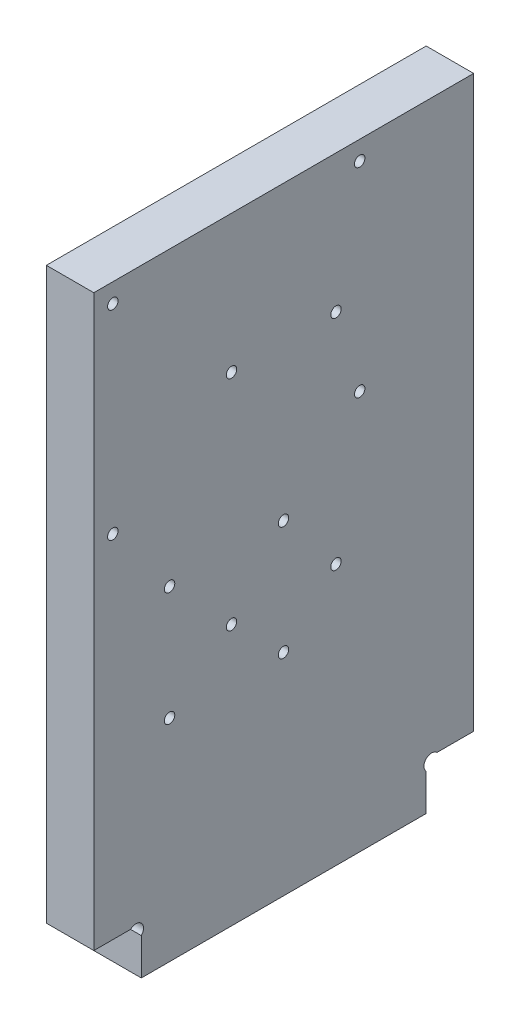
from build123d import *

# Parameters (mm, degrees)
ESQUISSE1_R             = 1.1
EXTRUSION1_DEPTH        = 10
ESQUISSE2_R             = 1.1
ENL_V_MAT_EXTRU_1_DEPTH = 2


with BuildPart() as part:
    # Esquisse1 → Extrusion1 (new body)
    with BuildSketch(Plane(origin=(0, 0, 0), x_dir=(0, 0, -1), z_dir=(1, 0, 0))):
        with BuildLine():
            Line((10, 7.7372583), (10, 0))
            Line((10, 0), (70, 0))
            Line((70, 0), (70, 7.7372583))
            ThreePointArc((70, 7.7372583), (70, 10), (72.2627417, 10))
            Line((72.2627417, 10), (80, 10))
            Line((80, 10), (80, 130))
            Line((80, 130), (0, 130))
            Line((0, 130), (0, 10))
            Line((0, 10), (7.7372583, 10))
            ThreePointArc((7.7372583, 10), (10, 10), (10, 7.7372583))
        make_face()
        with Locations((29, 101)):
            Circle(ESQUISSE1_R, mode=Mode.SUBTRACT)
        with Locations(Location((51, 101, 0), (0, 0, 180))):
            Circle(ESQUISSE1_R, mode=Mode.SUBTRACT)
        with Locations(Location((29, 55, 0), (0, 0, 180))):
            Circle(ESQUISSE1_R, mode=Mode.SUBTRACT)
        with Locations((51, 55)):
            Circle(ESQUISSE1_R, mode=Mode.SUBTRACT)
    extrude(amount=EXTRUSION1_DEPTH)

    # Esquisse2 → Enl_v. mat.-Extru.1 (cut)
    with BuildSketch(Plane(origin=(10, 0, 0), x_dir=(0, 0, -1), z_dir=(1, 0, 0))):
        with Locations((4, 126)):
            Circle(ESQUISSE2_R)
        with Locations(Location((56, 126, 0), (0, 0, 180))):
            Circle(ESQUISSE2_R)
        with Locations(Location((4, 84, 0), (0, 0, 180))):
            Circle(ESQUISSE2_R)
        with Locations((56, 84)):
            Circle(ESQUISSE2_R)
        with Locations((15.95, 68.45)):
            Circle(ESQUISSE2_R)
        with Locations((15.95, 44.45)):
            Circle(ESQUISSE2_R)
        with Locations((39.95, 44.45)):
            Circle(ESQUISSE2_R)
        with Locations((39.95, 68.45)):
            Circle(ESQUISSE2_R)
    extrude(amount=-ENL_V_MAT_EXTRU_1_DEPTH, mode=Mode.SUBTRACT)


solid = part.part
